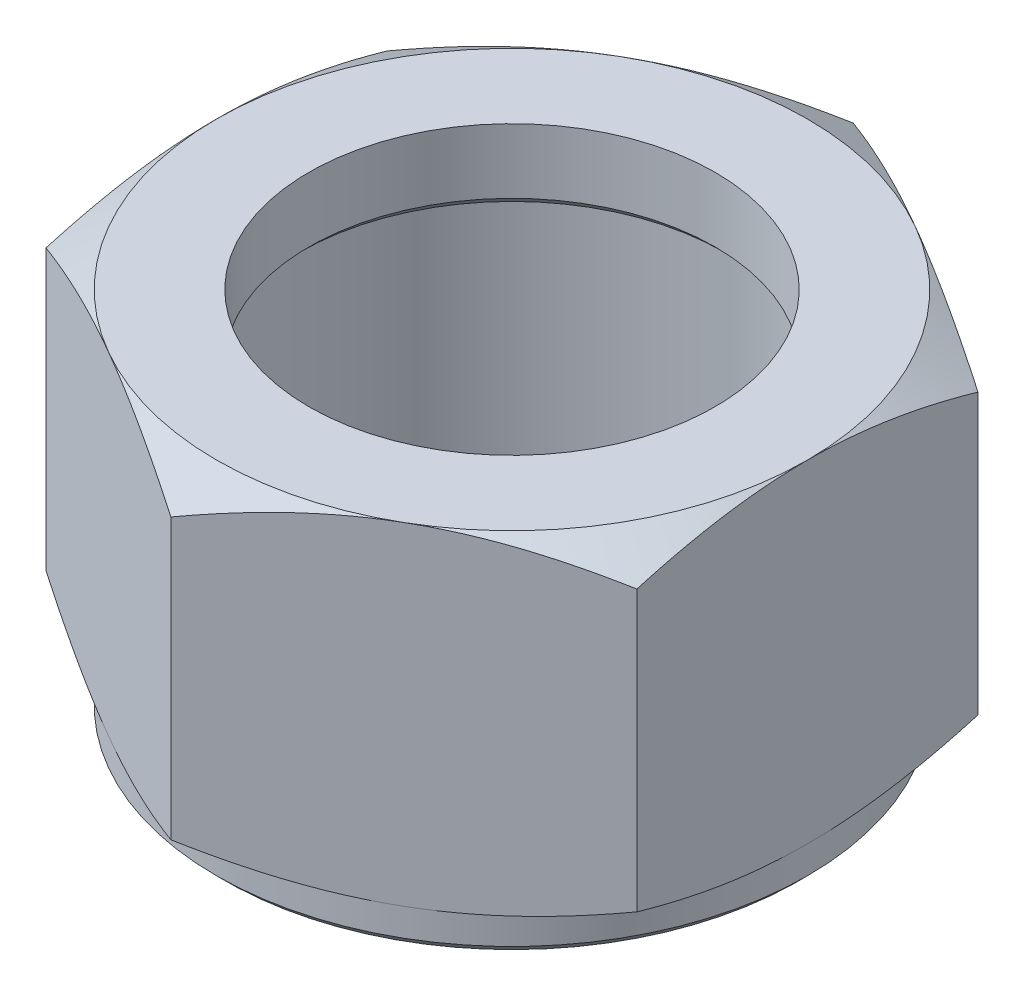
from build123d import *

# Parameters (mm, degrees)
P_IDAT_VYSUNUT_M1_DEPTH  = 18
SKICA2_OUTSIDE_W         = 106.772
SKICA2_OUTSIDE_H         = 111.722
SKICA2_OUTSIDE_R         = 16
ODEBRAT_VYSUNUT_M1_DEPTH = 18
ODEBRAT_VYSUNUT_M1_DRAFT = -60
SKICA3_OUTSIDE_W         = 106.772
SKICA3_OUTSIDE_H         = 111.722
SKICA3_OUTSIDE_R         = 16
ODEBRAT_VYSUNUT_M2_DEPTH = 18
ODEBRAT_VYSUNUT_M2_DRAFT = -60
SKICA4_R                 = 16
P_IDAT_VYSUNUT_M2_DEPTH  = 2
ZKOSEN_1_SIZE            = 0.5
SKICA5_R                 = 13
ODEBRAT_VYSUNUT_M3_DEPTH = 16
ODEBRAT_VYSUNUT_M4_REACH = 33.581
SKICA6_R                 = 11
ZKOSEN_2_SIZE            = 0.5


with BuildPart() as part:
    # Skica1 → P_idat vysunut_m1 (new body)
    with BuildSketch(Plane(origin=(0, 0, 0), x_dir=(1, 0, 0), z_dir=(0, 1, 0))):
        Polygon((0, 18.475208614), (-16, 9.237604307), (-16, -9.237604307), (0, -18.475208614), (16, -9.237604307), (16, 9.237604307), align=None)
    extrude(amount=P_IDAT_VYSUNUT_M1_DEPTH)


with BuildPart() as odebrat_vysunut_m1_tool:
    # Skica2 outside → Odebrat vysunut_m1 (with draft: the straight prism first)
    with BuildSketch(Plane(origin=(0, 18, 0), x_dir=(1, 0, 0), z_dir=(0, 1, 0))):
        Rectangle(SKICA2_OUTSIDE_W, SKICA2_OUTSIDE_H)
        Circle(SKICA2_OUTSIDE_R, mode=Mode.SUBTRACT)
    extrude(amount=-ODEBRAT_VYSUNUT_M1_DEPTH)
    # Odebrat vysunut_m1: the draft: its side faces are tilted about the plane it starts from
    odebrat_vysunut_m1_sides = [odebrat_vysunut_m1_tool.faces().sort_by_distance(p)[0] for p in [
        (0, 9, 55.861),
        (53.386, 9, 0),
        (0, 9, -55.861),
        (-53.386, 9, 0),
        (-16, 9, 0),
    ]]
    draft(odebrat_vysunut_m1_sides, Plane(origin=(0, 18, 0), x_dir=(1, 0, 0), z_dir=(0, 1, 0)), ODEBRAT_VYSUNUT_M1_DRAFT)


with BuildPart() as part_1:
    add(part.part)

    # Odebrat vysunut_m1: cut by odebrat_vysunut_m1_tool
    add(odebrat_vysunut_m1_tool.part, mode=Mode.SUBTRACT)


with BuildPart() as odebrat_vysunut_m2_tool:
    # Skica3 outside → Odebrat vysunut_m2 (with draft: the straight prism first)
    with BuildSketch(Plane.XZ):
        Rectangle(SKICA3_OUTSIDE_W, SKICA3_OUTSIDE_H)
        Circle(SKICA3_OUTSIDE_R, mode=Mode.SUBTRACT)
    extrude(amount=-ODEBRAT_VYSUNUT_M2_DEPTH)
    # Odebrat vysunut_m2: the draft: its side faces are tilted about the plane it starts from
    odebrat_vysunut_m2_sides = [odebrat_vysunut_m2_tool.faces().sort_by_distance(p)[0] for p in [
        (0, 9, -55.861),
        (53.386, 9, 0),
        (0, 9, 55.861),
        (-53.386, 9, 0),
        (-16, 9, 0),
    ]]
    draft(odebrat_vysunut_m2_sides, Plane.XZ, ODEBRAT_VYSUNUT_M2_DRAFT)


with BuildPart() as part_2:
    add(part_1.part)

    # Odebrat vysunut_m2: cut by odebrat_vysunut_m2_tool
    add(odebrat_vysunut_m2_tool.part, mode=Mode.SUBTRACT)

    # Skica4 → P_idat vysunut_m2 (add)
    with BuildSketch(Plane.XZ):
        with Locations(Location((0, 0, 0), (0, 0, 60))):
            Circle(SKICA4_R)
    extrude(amount=P_IDAT_VYSUNUT_M2_DEPTH)

    # Zkosen_1
    zkosen_1_edges = [part_2.edges().sort_by_distance(p)[0] for p in [
        (-8, -2, -13.856406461),
    ]]
    chamfer(zkosen_1_edges, length=ZKOSEN_1_SIZE)

    # Skica5 → Odebrat vysunut_m3 (cut)
    with BuildSketch(Plane.XZ.offset(2)):
        with Locations(Location((0, 0, 0), (0, 0, 270))):
            Circle(SKICA5_R)
    extrude(amount=-ODEBRAT_VYSUNUT_M3_DEPTH, mode=Mode.SUBTRACT)

    # Skica6 → Odebrat vysunut_m4 (cut, up to next)
    with BuildSketch(Plane(origin=(0, 18, 0), x_dir=(1, 0, 0), z_dir=(0, 1, 0)), mode=Mode.PRIVATE) as odebrat_vysunut_m4_sk1:
        with Locations(Location((0, 0, 0), (0, 0, 270))):
            Circle(SKICA6_R)
    odebrat_vysunut_m4_tool1 = extrude(odebrat_vysunut_m4_sk1.sketch, amount=-ODEBRAT_VYSUNUT_M4_REACH, mode=Mode.PRIVATE) & part_2.part
    add(odebrat_vysunut_m4_tool1.solids().sort_by_distance((0, 18, 0))[0], mode=Mode.SUBTRACT)

    # Zkosen_2
    zkosen_2_edges = [part_2.edges().sort_by_distance(p)[0] for p in [
        (0, 14, -11),
    ]]
    chamfer(zkosen_2_edges, length=ZKOSEN_2_SIZE)


solid = part_2.part
